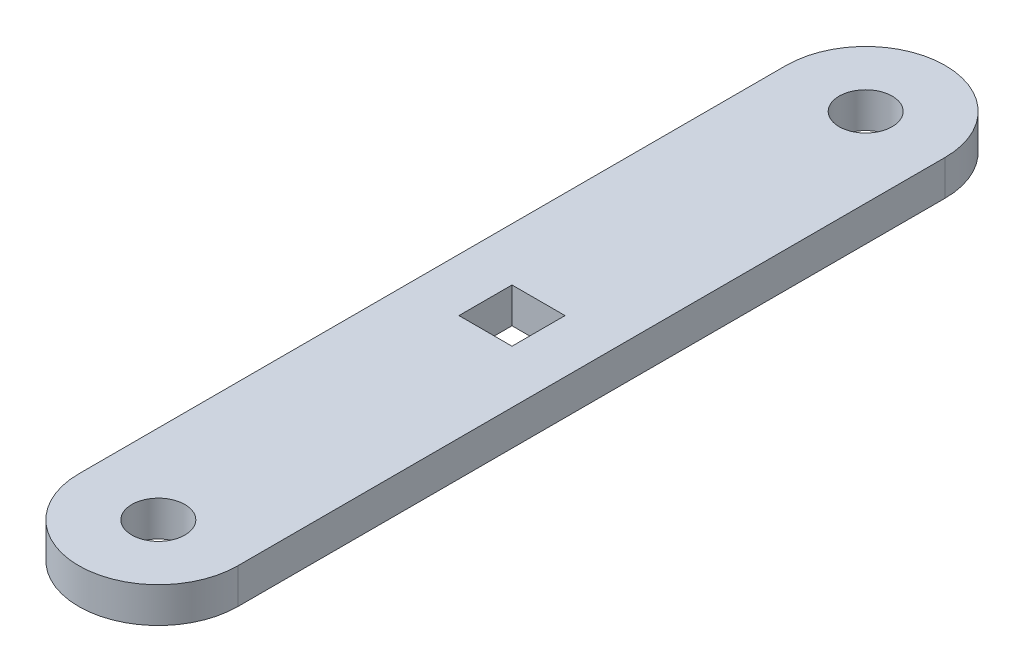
from build123d import *

# Parameters (mm, degrees)
SKETCH1_W           = 450
SKETCH1_H           = 2000
BOSS_EXTRUDE1_DEPTH = 100
CUT_EXTRUDE2_DEPTH  = 250
CUT_EXTRUDE4_DEPTH  = 1250.49989996
SKETCH4_W           = 150
SKETCH4_H           = 150
CUT_EXTRUDE5_DEPTH  = 1250.49989996


with BuildPart() as part:
    # Sketch1 → Boss-Extrude1 (new body)
    with BuildSketch(Plane(origin=(0, 0, 0), x_dir=(1, 0, 0), z_dir=(0, 1, 0))):
        Rectangle(SKETCH1_W, SKETCH1_H)
        with BuildLine():
            Line((-225, 1000), (225, 1000))
            ThreePointArc((225, 1000), (0, 1225), (-225, 1000))
        make_face()
        with BuildLine():
            ThreePointArc((225, -1000), (0, -1225), (-225, -1000))
            Line((-225, -1000), (225, -1000))
        make_face()
    extrude(amount=BOSS_EXTRUDE1_DEPTH)

    # Sketch3 → Cut-Extrude2 (cut)
    with BuildSketch(Plane(origin=(0, 100, 0), x_dir=(1, 0, 0), z_dir=(0, 1, 0))):
        with BuildLine():
            ThreePointArc((75, 1000), (0, 1075), (-75, 1000))
            Line((-75, 1000), (75, 1000))
        make_face()
        with BuildLine():
            Line((75, 1000), (-75, 1000))
            ThreePointArc((-75, 1000), (0, 925), (75, 1000))
        make_face()
        with BuildLine():
            ThreePointArc((75, 1000), (0, 1075), (-75, 1000))
            Line((-75, 1000), (75, 1000))
        make_face()
        with BuildLine():
            Line((75, 1000), (-75, 1000))
            ThreePointArc((-75, 1000), (0, 925), (75, 1000))
        make_face()
    extrude(amount=-CUT_EXTRUDE2_DEPTH, mode=Mode.SUBTRACT)

    # Sketch2 → Cut-Extrude4 (cut, through all)
    with BuildSketch(Plane(origin=(0, 100, 0), x_dir=(1, 0, 0), z_dir=(0, 1, 0))):
        with BuildLine():
            ThreePointArc((75, -1000), (0, -925), (-75, -1000))
            Line((-75, -1000), (75, -1000))
        make_face()
        with BuildLine():
            Line((75, -1000), (-75, -1000))
            ThreePointArc((-75, -1000), (0, -1075), (75, -1000))
        make_face()
        with BuildLine():
            ThreePointArc((75, -1000), (0, -925), (-75, -1000))
            Line((-75, -1000), (75, -1000))
        make_face()
        with BuildLine():
            Line((75, -1000), (-75, -1000))
            ThreePointArc((-75, -1000), (0, -1075), (75, -1000))
        make_face()
    extrude(amount=-CUT_EXTRUDE4_DEPTH, mode=Mode.SUBTRACT)

    # Sketch4 → Cut-Extrude5 (cut, through all)
    with BuildSketch(Plane(origin=(0, 100, 0), x_dir=(1, 0, 0), z_dir=(0, 1, 0))):
        Rectangle(SKETCH4_W, SKETCH4_H)
    extrude(amount=-CUT_EXTRUDE5_DEPTH, mode=Mode.SUBTRACT)


solid = part.part
